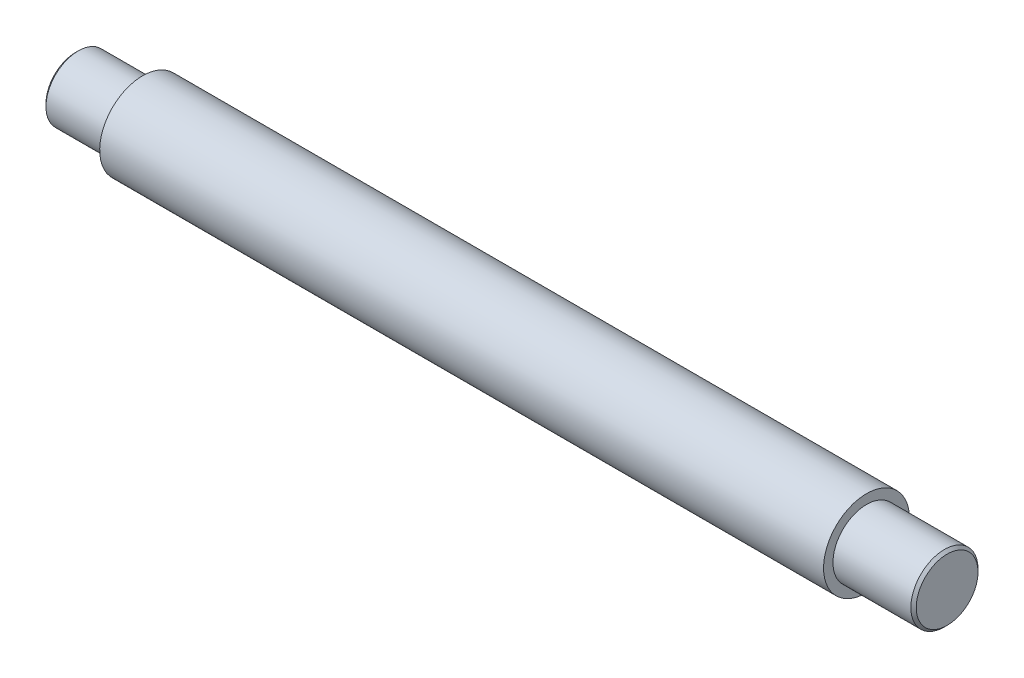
from build123d import *

# Parameters (mm, degrees)
ENL_V_MAT_EXTRU_1_DEPTH = 10
ENL_V_MAT_EXTRU_2_DEPTH = 48
CHANFREIN1_SIZE         = 1


with BuildPart() as part:
    # Esquisse2 → R_volution1 (revolve)
    with BuildSketch(Plane(origin=(0, 370.999683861, -115.203114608), x_dir=(1, 0, 0), z_dir=(-1.0908795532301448e-15, -0.9550165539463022, 0.29655249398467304)), mode=Mode.PRIVATE) as r_volution1_sk:
        Polygon((311.461782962, 222.210416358), (311.461782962, 210.710416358), (-13, 210.710416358), (-13, 222.710416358), (12, 222.710416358), (12, 226.710416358), (281.461782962, 226.710416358), (281.461782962, 223.210416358), (310.461782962, 223.210416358), align=None)
    revolve(r_volution1_sk.sketch.rotate(Axis((-27.883598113, 433.48638334, 86.028821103), (1, 0, 0)), 107.25065508), axis=Axis((-27.883598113, 433.48638334, 86.028821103), (1, 0, 0)))

    # Esquisse3 → Enl_v. mat.-Extru.1 (cut)
    with BuildSketch(Plane(origin=(0, 421.48638334, 0), x_dir=(-1, 0, 0), z_dir=(0, 1, 0))):
        with BuildLine():
            Line((-207.961782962, 90.028821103), (-195.961782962, 90.028821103))
            ThreePointArc((-195.961782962, 90.028821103), (-191.961782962, 86.028821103), (-195.961782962, 82.028821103))
            Line((-195.961782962, 82.028821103), (-207.961782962, 82.028821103))
            ThreePointArc((-207.961782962, 82.028821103), (-211.961782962, 86.028821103), (-207.961782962, 90.028821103))
        make_face()
        with BuildLine():
            Line((-51.961782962, 90.028821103), (-39.961782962, 90.028821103))
            ThreePointArc((-39.961782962, 90.028821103), (-35.961782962, 86.028821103), (-39.961782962, 82.028821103))
            Line((-39.961782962, 82.028821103), (-51.961782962, 82.028821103))
            ThreePointArc((-51.961782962, 82.028821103), (-55.961782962, 86.028821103), (-51.961782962, 90.028821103))
        make_face()
    extrude(amount=-ENL_V_MAT_EXTRU_1_DEPTH, mode=Mode.SUBTRACT)

    # Esquisse4 → Enl_v. mat.-Extru.2 (cut)
    with BuildSketch(Plane(origin=(0, 55.966827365, -112.25208965), x_dir=(-1, 0, 0), z_dir=(-1.1054907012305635e-15, -0.4461978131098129, 0.8949343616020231))):
        with BuildLine():
            Line((-305.461782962, -423.327731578), (-287.461782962, -423.327731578))
            ThreePointArc((-287.461782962, -423.327731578), (-284.461782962, -426.327731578), (-287.461782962, -429.327731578))
            Line((-287.461782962, -429.327731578), (-305.461782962, -429.327731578))
            ThreePointArc((-305.461782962, -429.327731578), (-308.461782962, -426.327731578), (-305.461782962, -423.327731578))
        make_face()
    extrude(amount=-ENL_V_MAT_EXTRU_2_DEPTH, mode=Mode.SUBTRACT)

    # Chanfrein1
    chanfrein1_edges = [part.edges().sort_by_distance(p)[0] for p in [
        (-13, 445.48638334, 86.028821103),
    ]]
    chamfer(chanfrein1_edges, length=CHANFREIN1_SIZE)


solid = part.part
